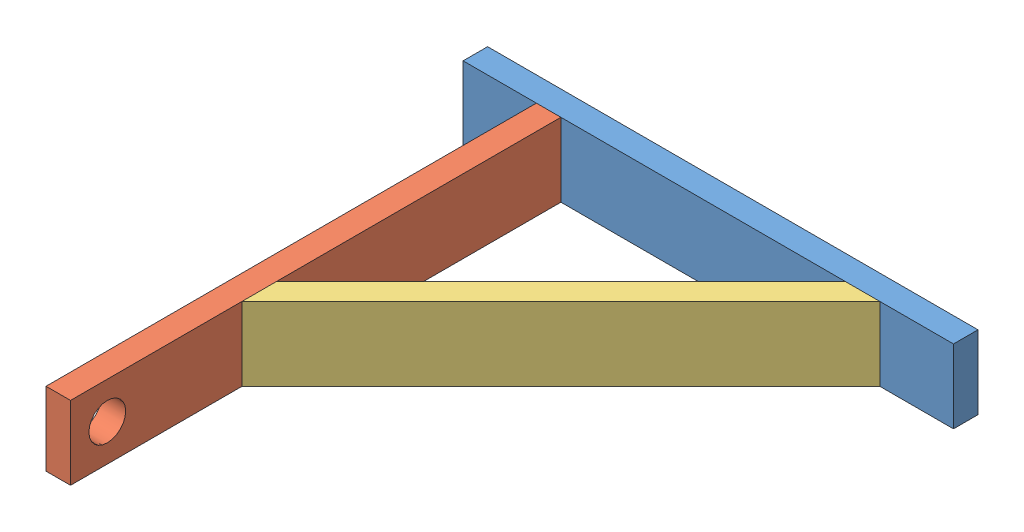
SolidWorks assembly HANGER.SLDASM, configuration Default (file format 4400). Lengths in mm.
Overall size (200 30 210).
3 component instances, 3 part files, 6 mates.
Components (placement in the parent):
- HANGER_1-1: HANGER_1.SLDPRT [Default] at origin size (200 30 10)
- HANGER_2-1: HANGER_2.SLDPRT [Default] at (39.8924 0 10) x (0 0 1) z (-1 0 0) size (200 30 10)
- HANGER_3-2: HANGER_3.SLDPRT [Default] at (39.8924 30 10) x (0 0 1) z (0 -1 0) size (130.11 130.11 30)
Mates (geometry in assembly coordinates):
- Coincident1: coincident anti-aligned: plane of HANGER_2-1 through (39.8924 30 10) normal (1 0 0); plane of HANGER_3-2 through (39.8924 0 140.1076) normal (-1 0 0)
- Coincident2: coincident anti-aligned: plane of HANGER_1-1 through (0 30 10) normal (0 0 1); plane of HANGER_3-2 through (155.8579 0 10) normal (0 0 -1)
- Coincident3: coincident aligned: plane of HANGER_2-1 through (29.8924 0 10) normal (0 -1 0); plane of HANGER_3-2 through (39.8924 0 10) normal (0 -1 0)
- Coincident4: coincident aligned: plane of HANGER_1-1 through (0 30 10) normal (0 1 0); plane of HANGER_3-2 through (39.8924 30 10) normal (0 1 0)
- Distance1: distance = 30 mm: line of HANGER_1-1 through (200 0 10) axis (0 1 0); line of HANGER_3-2 through (170 0 10) axis (0 1 0)
- Coincident5: coincident anti-aligned: plane of HANGER_1-1 through (0 30 10) normal (0 0 1); plane of HANGER_2-1 through (29.8924 0 10) normal (0 0 -1); plane of HANGER_1-1 through (0 30 10) normal (0 0 1); plane of HANGER_2-1 through (39.8924 30 10) normal (1 0 0)
